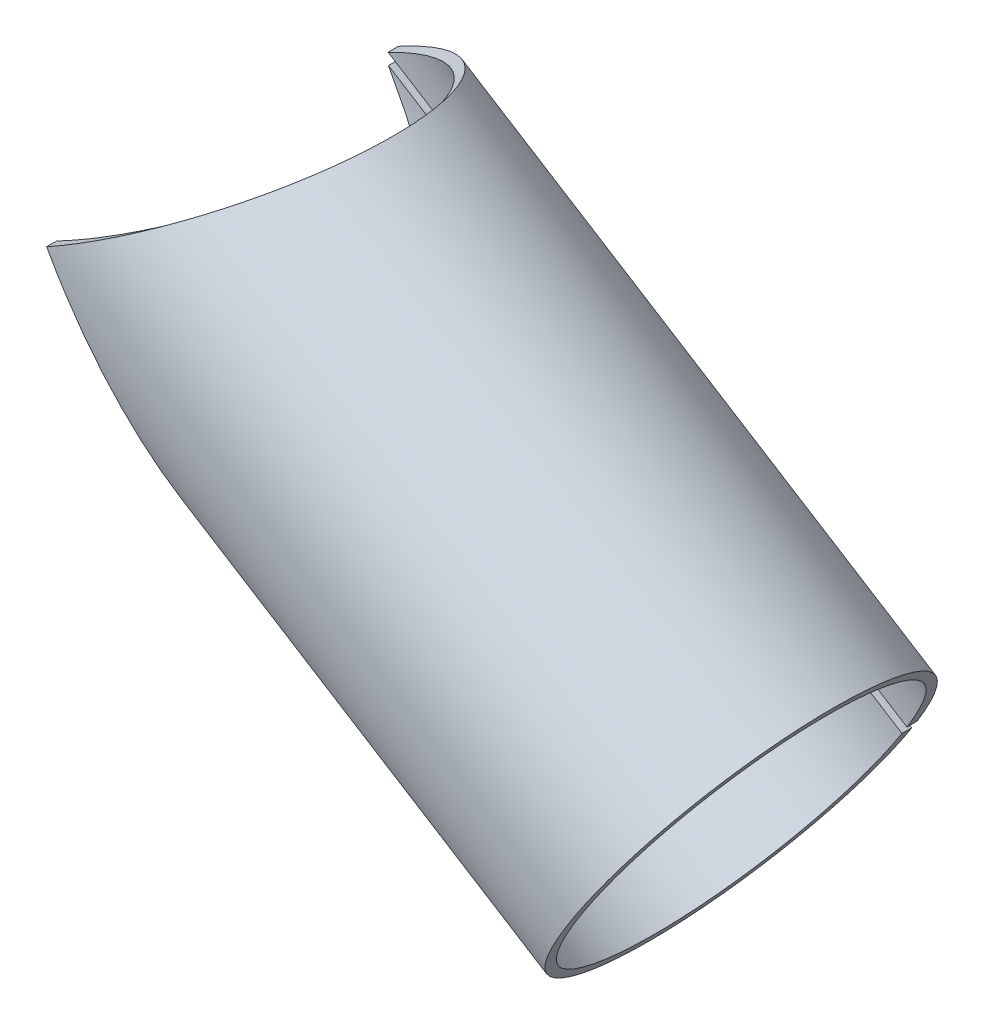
ISO-10303-21;
HEADER;
FILE_DESCRIPTION(('STEP AP214'),'2;1');
FILE_NAME('part.step','',(''),(''),'','','');
FILE_SCHEMA(('AUTOMOTIVE_DESIGN { 1 0 10303 214 1 1 1 1 }'));
ENDSEC;
DATA;
#1=APPLICATION_CONTEXT('core data for automotive mechanical design processes');
#2=APPLICATION_PROTOCOL_DEFINITION('international standard','automotive_design',2000,#1);
#3=PRODUCT_CONTEXT('',#1,'mechanical');
#4=PRODUCT('Part','Part','',(#3));
#5=PRODUCT_RELATED_PRODUCT_CATEGORY('part','',(#4));
#6=PRODUCT_DEFINITION_FORMATION('','',#4);
#7=PRODUCT_DEFINITION_CONTEXT('part definition',#1,'design');
#8=PRODUCT_DEFINITION('design','',#6,#7);
#9=PRODUCT_DEFINITION_SHAPE('','',#8);
#10=(LENGTH_UNIT() NAMED_UNIT(*) SI_UNIT(.MILLI.,.METRE.));
#11=(NAMED_UNIT(*) PLANE_ANGLE_UNIT() SI_UNIT($,.RADIAN.));
#12=(NAMED_UNIT(*) SI_UNIT($,.STERADIAN.) SOLID_ANGLE_UNIT());
#13=UNCERTAINTY_MEASURE_WITH_UNIT(LENGTH_MEASURE(1.E-05),#10,'distance_accuracy_value','');
#14=(GEOMETRIC_REPRESENTATION_CONTEXT(3) GLOBAL_UNCERTAINTY_ASSIGNED_CONTEXT((#13)) GLOBAL_UNIT_ASSIGNED_CONTEXT((#10,
#11,#12)) REPRESENTATION_CONTEXT('',''));
#15=CARTESIAN_POINT('',(0.,0.,0.));
#16=DIRECTION('',(0.,0.,1.));
#17=DIRECTION('',(1.,0.,0.));
#18=AXIS2_PLACEMENT_3D('',#15,#16,#17);
#19=CARTESIAN_POINT('',(0.,-3.11703878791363E-13,17.3630786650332));
#20=CARTESIAN_POINT('',(0.844727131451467,-1.5259496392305,17.3630786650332));
#21=CARTESIAN_POINT('',(1.53237967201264,-2.7692713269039,17.3035122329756));
#22=CARTESIAN_POINT('',(2.1969852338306,-3.96903968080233,17.2240064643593));
#23=CARTESIAN_POINT('',(2.32012526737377,-4.19130847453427,17.2077302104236));
#24=CARTESIAN_POINT('',(2.49012200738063,-4.49825090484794,17.1836843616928));
#25=CARTESIAN_POINT('',(2.54362682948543,-4.59488396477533,17.1758370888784));
#26=CARTESIAN_POINT('',(2.64991148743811,-4.78685825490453,17.1597635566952));
#27=CARTESIAN_POINT('',(2.70272431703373,-4.88225643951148,17.1515235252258));
#28=CARTESIAN_POINT('',(2.96514365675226,-5.35629826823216,17.1093485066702));
#29=CARTESIAN_POINT('',(3.16981709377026,-5.72609247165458,17.0724907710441));
#30=CARTESIAN_POINT('',(3.76812123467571,-6.80704566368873,16.9541132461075));
#31=CARTESIAN_POINT('',(4.14604926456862,-7.48975368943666,16.8648147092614));
#32=CARTESIAN_POINT('',(4.68153132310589,-8.4569212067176,16.7210499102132));
#33=CARTESIAN_POINT('',(4.85478676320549,-8.76983367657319,16.671485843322));
#34=CARTESIAN_POINT('',(5.19078330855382,-9.37676455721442,16.5699542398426));
#35=CARTESIAN_POINT('',(5.35508111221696,-9.67359397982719,16.5175314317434));
#36=CARTESIAN_POINT('',(6.16561384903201,-11.1379633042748,16.2458461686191));
#37=CARTESIAN_POINT('',(6.77155874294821,-12.232518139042,16.0002186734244));
#38=CARTESIAN_POINT('',(7.47584612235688,-13.504603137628,15.6720288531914));
#39=CARTESIAN_POINT('',(7.61377909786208,-13.7537574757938,15.6054579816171));
#40=CARTESIAN_POINT('',(7.88617623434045,-14.2458431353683,15.4695810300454));
#41=CARTESIAN_POINT('',(8.02053282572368,-14.4885733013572,15.4003184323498));
#42=CARTESIAN_POINT('',(8.41808989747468,-15.2068046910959,15.1888476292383));
#43=CARTESIAN_POINT('',(8.67577957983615,-15.6723437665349,15.0429583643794));
#44=CARTESIAN_POINT('',(9.17648493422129,-16.5768219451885,14.7428610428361));
#45=CARTESIAN_POINT('',(9.41950039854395,-17.0157613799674,14.5886531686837));
#46=CARTESIAN_POINT('',(9.89082117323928,-17.8670979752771,14.2733531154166));
#47=CARTESIAN_POINT('',(10.118705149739,-18.2787772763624,14.1125666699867));
#48=CARTESIAN_POINT('',(10.7852706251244,-19.4830351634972,13.6182769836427));
#49=CARTESIAN_POINT('',(11.2058389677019,-20.2428265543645,13.2734928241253));
#50=CARTESIAN_POINT('',(11.8010334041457,-21.3178552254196,12.7389773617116));
#51=CARTESIAN_POINT('',(11.9934844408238,-21.6654282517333,12.5579119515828));
#52=CARTESIAN_POINT('',(12.3664555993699,-22.3390931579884,12.1908703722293));
#53=CARTESIAN_POINT('',(12.5468713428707,-22.6650265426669,12.0050023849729));
#54=CARTESIAN_POINT('',(13.0730919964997,-23.6157222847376,11.4383231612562));
#55=CARTESIAN_POINT('',(13.4029731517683,-24.2117023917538,11.0493157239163));
#56=CARTESIAN_POINT('',(14.0209461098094,-25.3279073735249,10.2539205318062));
#57=CARTESIAN_POINT('',(14.309036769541,-25.8481340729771,9.84753429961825));
#58=CARTESIAN_POINT('',(14.8432170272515,-26.8131702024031,9.02217466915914));
#59=CARTESIAN_POINT('',(15.0906269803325,-27.2603399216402,8.60122350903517));
#60=CARTESIAN_POINT('',(15.7750634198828,-28.4970911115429,7.31784737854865));
#61=CARTESIAN_POINT('',(16.1538533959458,-29.1808349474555,6.43592208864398));
#62=CARTESIAN_POINT('',(16.7562738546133,-30.269228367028,4.64658894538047));
#63=CARTESIAN_POINT('',(16.9823495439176,-30.6782954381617,3.73178893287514));
#64=CARTESIAN_POINT('',(17.2850615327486,-31.2248458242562,1.88701543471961));
#65=CARTESIAN_POINT('',(17.3613627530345,-31.3621514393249,0.958023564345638));
#66=CARTESIAN_POINT('',(17.364746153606,-31.3682168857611,-0.895367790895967));
#67=CARTESIAN_POINT('',(17.2914495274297,-31.2365687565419,-1.82587882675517));
#68=CARTESIAN_POINT('',(17.0696525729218,-30.8358587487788,-3.20967373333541));
#69=CARTESIAN_POINT('',(16.9770673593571,-30.6684447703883,-3.66890873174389));
#70=CARTESIAN_POINT('',(16.7545128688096,-30.266053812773,-4.58022479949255));
#71=CARTESIAN_POINT('',(16.6247158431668,-30.031443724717,-5.03168650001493));
#72=CARTESIAN_POINT('',(16.1774955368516,-29.2237909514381,-6.37577019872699));
#73=CARTESIAN_POINT('',(15.8022331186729,-28.5460992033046,-7.258908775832));
#74=CARTESIAN_POINT('',(15.1239071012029,-27.3202921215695,-8.54277344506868));
#75=CARTESIAN_POINT('',(14.8789574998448,-26.8776600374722,-8.9632142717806));
#76=CARTESIAN_POINT('',(14.3478727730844,-25.9184134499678,-9.79071006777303));
#77=CARTESIAN_POINT('',(14.0617248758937,-25.4016253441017,-10.1978139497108));
#78=CARTESIAN_POINT('',(13.448325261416,-24.2935483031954,-10.9941077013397));
#79=CARTESIAN_POINT('',(13.1210745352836,-23.7022577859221,-11.3832960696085));
#80=CARTESIAN_POINT('',(12.4253054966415,-22.4454373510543,-12.138899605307));
#81=CARTESIAN_POINT('',(12.0547610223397,-21.7763161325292,-12.507505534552));
#82=CARTESIAN_POINT('',(11.2669820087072,-20.3533211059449,-13.2215323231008));
#83=CARTESIAN_POINT('',(10.8500138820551,-19.5999143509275,-13.5666681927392));
#84=CARTESIAN_POINT('',(9.96973242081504,-18.0095824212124,-14.2261946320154));
#85=CARTESIAN_POINT('',(9.50151617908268,-17.1639841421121,-14.5441676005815));
#86=CARTESIAN_POINT('',(8.75673051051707,-15.8185241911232,-14.9959763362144));
#87=CARTESIAN_POINT('',(8.50141807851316,-15.3572604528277,-15.1423564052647));
#88=CARTESIAN_POINT('',(7.97665241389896,-14.4092422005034,-15.4252705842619));
#89=CARTESIAN_POINT('',(7.70715771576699,-13.9224689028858,-15.5618832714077));
#90=CARTESIAN_POINT('',(6.86641915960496,-12.4039340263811,-15.9596581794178));
#91=CARTESIAN_POINT('',(6.26671565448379,-11.3204338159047,-16.2068129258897));
#92=CARTESIAN_POINT('',(5.46790991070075,-9.87738833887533,-16.4805095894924));
#93=CARTESIAN_POINT('',(5.30529526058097,-9.58366467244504,-16.5336341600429));
#94=CARTESIAN_POINT('',(4.97011661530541,-8.97826527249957,-16.6374427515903));
#95=CARTESIAN_POINT('',(4.79814999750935,-8.66766028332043,-16.6879207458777));
#96=CARTESIAN_POINT('',(4.26914318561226,-7.71208965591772,-16.8339992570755));
#97=CARTESIAN_POINT('',(3.89900748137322,-7.04335008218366,-16.9242608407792));
#98=CARTESIAN_POINT('',(3.41443640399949,-6.16792306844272,-17.024337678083));
#99=CARTESIAN_POINT('',(3.31642622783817,-5.99086395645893,-17.043714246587));
#100=CARTESIAN_POINT('',(3.16776289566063,-5.72232131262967,-17.0717450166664));
#101=CARTESIAN_POINT('',(3.11793376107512,-5.63231478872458,-17.0809162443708));
#102=CARTESIAN_POINT('',(3.01772526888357,-5.45131846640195,-17.0989011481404));
#103=CARTESIAN_POINT('',(2.96741382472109,-5.36045191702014,-17.107706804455));
#104=CARTESIAN_POINT('',(2.7078670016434,-4.8917605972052,-17.1518932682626));
#105=CARTESIAN_POINT('',(2.47991873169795,-4.48027693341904,-17.1868288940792));
#106=CARTESIAN_POINT('',(1.73541252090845,-3.13580145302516,-17.2832999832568));
#107=CARTESIAN_POINT('',(1.15837604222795,-2.09260506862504,-17.3369091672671));
#108=CARTESIAN_POINT('',(0.500000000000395,-0.90321633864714,-17.3558779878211));
#109=CARTESIAN_POINT('',(0.,-2.9813402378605E-13,16.3630786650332));
#110=CARTESIAN_POINT('',(0.870546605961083,-1.4847066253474,16.3630786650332));
#111=CARTESIAN_POINT('',(1.57926082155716,-2.69443244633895,16.3069428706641));
#112=CARTESIAN_POINT('',(2.26416576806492,-3.86179580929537,16.2320161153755));
#113=CARTESIAN_POINT('',(2.39106621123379,-4.07806166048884,16.2166772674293));
#114=CARTESIAN_POINT('',(2.56625676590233,-4.37671292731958,16.1940163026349));
#115=CARTESIAN_POINT('',(2.62139696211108,-4.47073535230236,16.1866209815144));
#116=CARTESIAN_POINT('',(2.73093066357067,-4.65752302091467,16.1714731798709));
#117=CARTESIAN_POINT('',(2.78535810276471,-4.75034371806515,16.1637077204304));
#118=CARTESIAN_POINT('',(3.05580077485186,-5.21157747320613,16.1239617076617));
#119=CARTESIAN_POINT('',(3.26673370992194,-5.57137930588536,16.0892267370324));
#120=CARTESIAN_POINT('',(3.88333481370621,-6.62312407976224,15.9776669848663));
#121=CARTESIAN_POINT('',(4.27281799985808,-7.28738599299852,15.8935114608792));
#122=CARTESIAN_POINT('',(4.8246684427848,-8.22842378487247,15.7580265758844));
#123=CARTESIAN_POINT('',(5.00321949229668,-8.53288259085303,15.711317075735));
#124=CARTESIAN_POINT('',(5.34948836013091,-9.12341521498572,15.6156330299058));
#125=CARTESIAN_POINT('',(5.5188104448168,-9.41222410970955,15.5662294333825));
#126=CARTESIAN_POINT('',(6.35412996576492,-10.8370249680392,15.3101914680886));
#127=CARTESIAN_POINT('',(6.97860023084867,-11.9020067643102,15.0787105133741));
#128=CARTESIAN_POINT('',(7.70441667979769,-13.1397237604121,14.7694222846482));
#129=CARTESIAN_POINT('',(7.84656657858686,-13.3821463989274,14.7066854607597));
#130=CARTESIAN_POINT('',(8.12729262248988,-13.8609361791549,14.5786341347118));
#131=CARTESIAN_POINT('',(8.26575773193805,-14.097107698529,14.5133606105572));
#132=CARTESIAN_POINT('',(8.6754717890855,-14.7959322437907,14.3140691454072));
#133=CARTESIAN_POINT('',(8.94104126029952,-15.248892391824,14.1765821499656));
#134=CARTESIAN_POINT('',(9.45705514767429,-16.1289327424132,13.8937684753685));
#135=CARTESIAN_POINT('',(9.70749936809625,-16.5560132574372,13.7484419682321));
#136=CARTESIAN_POINT('',(10.1932286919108,-17.3843487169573,13.4513011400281));
#137=CARTESIAN_POINT('',(10.4280807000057,-17.7849045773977,13.2997749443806));
#138=CARTESIAN_POINT('',(11.1150300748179,-18.9566225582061,12.833953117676));
#139=CARTESIAN_POINT('',(11.5484587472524,-19.695884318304,12.5090262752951));
#140=CARTESIAN_POINT('',(12.1618471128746,-20.7418690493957,12.0052954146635));
#141=CARTESIAN_POINT('',(12.3601802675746,-21.080052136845,11.8346581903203));
#142=CARTESIAN_POINT('',(12.7445527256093,-21.7355165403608,11.4887558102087));
#143=CARTESIAN_POINT('',(12.9304852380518,-22.0526432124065,11.3135926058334));
#144=CARTESIAN_POINT('',(13.4727978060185,-22.9776505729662,10.7795504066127));
#145=CARTESIAN_POINT('',(13.8127668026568,-23.5575269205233,10.4129472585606));
#146=CARTESIAN_POINT('',(14.449630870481,-24.6435750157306,9.66336163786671));
#147=CARTESIAN_POINT('',(14.7465248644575,-25.1497484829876,9.28038060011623));
#148=CARTESIAN_POINT('',(15.2970394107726,-26.0887093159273,8.50255629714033));
#149=CARTESIAN_POINT('',(15.5520200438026,-26.5237935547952,8.10584917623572));
#150=CARTESIAN_POINT('',(16.2573922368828,-27.7271238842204,6.89638713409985));
#151=CARTESIAN_POINT('',(16.647750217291,-28.3924010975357,6.06525498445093));
#152=CARTESIAN_POINT('',(17.2685936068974,-29.4513850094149,4.37897575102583));
#153=CARTESIAN_POINT('',(17.5015989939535,-29.8493898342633,3.5168622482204));
#154=CARTESIAN_POINT('',(17.8135590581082,-30.3811770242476,1.77833566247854));
#155=CARTESIAN_POINT('',(17.892179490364,-30.514780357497,0.902847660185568));
#156=CARTESIAN_POINT('',(17.8956651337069,-30.5206825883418,-0.843800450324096));
#157=CARTESIAN_POINT('',(17.8201471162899,-30.3925805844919,-1.72072012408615));
#158=CARTESIAN_POINT('',(17.5915675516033,-30.0026980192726,-3.02481747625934));
#159=CARTESIAN_POINT('',(17.4961473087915,-29.8398097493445,-3.45760353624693));
#160=CARTESIAN_POINT('',(17.2667789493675,-29.4482961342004,-4.31643374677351));
#161=CARTESIAN_POINT('',(17.1330097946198,-29.2200269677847,-4.7418942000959));
#162=CARTESIAN_POINT('',(16.6721216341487,-28.4341929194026,-6.00856745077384));
#163=CARTESIAN_POINT('',(16.2853907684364,-27.7748088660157,-6.84084301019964));
#164=CARTESIAN_POINT('',(15.5863133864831,-26.5821282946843,-8.05076545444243));
#165=CARTESIAN_POINT('',(15.3338707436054,-26.1514577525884,-8.44699163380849));
#166=CARTESIAN_POINT('',(14.7865514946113,-25.2181271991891,-9.22682907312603));
#167=CARTESIAN_POINT('',(14.4916578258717,-24.715300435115,-9.61048642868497));
#168=CARTESIAN_POINT('',(13.8595034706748,-23.6371625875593,-10.3609188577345));
#169=CARTESIAN_POINT('',(13.5222437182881,-23.0618500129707,-10.7276925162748));
#170=CARTESIAN_POINT('',(12.8052028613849,-21.8389869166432,-11.4397782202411));
#171=CARTESIAN_POINT('',(12.4233354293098,-21.1879411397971,-11.7871548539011));
#172=CARTESIAN_POINT('',(11.6114723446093,-19.8033928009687,-12.4600583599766));
#173=CARTESIAN_POINT('',(11.1817508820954,-19.0703448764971,-12.7853166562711));
#174=CARTESIAN_POINT('',(10.2745509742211,-17.5229842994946,-13.4068586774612));
#175=CARTESIAN_POINT('',(9.79202447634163,-16.7002302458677,-13.7065184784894));
#176=CARTESIAN_POINT('',(9.02446588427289,-15.391123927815,-14.1323059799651));
#177=CARTESIAN_POINT('',(8.76134585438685,-14.942323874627,-14.2702555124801));
#178=CARTESIAN_POINT('',(8.22053403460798,-14.0199209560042,-14.5368756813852));
#179=CARTESIAN_POINT('',(7.94280096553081,-13.5462990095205,-14.6656203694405));
#180=CARTESIAN_POINT('',(7.07636243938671,-12.0687903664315,-15.0404860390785));
#181=CARTESIAN_POINT('',(6.45831868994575,-11.014567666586,-15.2734062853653));
#182=CARTESIAN_POINT('',(5.63508833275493,-9.61051250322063,-15.5313398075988));
#183=CARTESIAN_POINT('',(5.46750255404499,-9.32472451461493,-15.5814047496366));
#184=CARTESIAN_POINT('',(5.12207799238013,-8.73568121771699,-15.6792346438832));
#185=CARTESIAN_POINT('',(4.94485463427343,-8.43346784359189,-15.7268054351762));
#186=CARTESIAN_POINT('',(4.39967481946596,-7.50371504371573,-15.8644707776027));
#187=CARTESIAN_POINT('',(4.01821941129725,-6.8530457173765,-15.9495338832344));
#188=CARTESIAN_POINT('',(3.5188306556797,-6.00127295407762,-16.0438469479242));
#189=CARTESIAN_POINT('',(3.41782359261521,-5.82899793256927,-16.0621075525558));
#190=CARTESIAN_POINT('',(3.26461514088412,-5.5677109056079,-16.0885239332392));
#191=CARTESIAN_POINT('',(3.21326266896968,-5.48013616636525,-16.0971669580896));
#192=CARTESIAN_POINT('',(3.10999095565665,-5.30402982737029,-16.1141160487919));
#193=CARTESIAN_POINT('',(3.05814171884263,-5.21561813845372,-16.1224145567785));
#194=CARTESIAN_POINT('',(2.79066357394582,-4.75958801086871,-16.1640561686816));
#195=CARTESIAN_POINT('',(2.555753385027,-4.35921802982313,-16.1969797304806));
#196=CARTESIAN_POINT('',(1.78849522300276,-3.05106270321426,-16.2878947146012));
#197=CARTESIAN_POINT('',(1.19379190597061,-2.03605900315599,-16.3384164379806));
#198=CARTESIAN_POINT('',(0.515287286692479,-0.878812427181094,-16.3562926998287));
#199=B_SPLINE_SURFACE_WITH_KNOTS('',1,3,((#19,#20,#21,#22,#23,#24,#25,#26,#27,#28,#29,#30,#31,
#32,#33,#34,#35,#36,#37,#38,#39,#40,#41,#42,#43,#44,#45,#46,#47,#48,#49,#50,#51,#52,#53,#54,#55,
#56,#57,#58,#59,#60,#61,#62,#63,#64,#65,#66,#67,#68,#69,#70,#71,#72,#73,#74,#75,#76,#77,#78,#79,
#80,#81,#82,#83,#84,#85,#86,#87,#88,#89,#90,#91,#92,#93,#94,#95,#96,#97,#98,#99,#100,#101,#102,
#103,#104,#105,#106,#107,#108),(#109,#110,#111,#112,#113,#114,#115,#116,#117,#118,#119,#120,
#121,#122,#123,#124,#125,#126,#127,#128,#129,#130,#131,#132,#133,#134,#135,#136,#137,#138,#139,
#140,#141,#142,#143,#144,#145,#146,#147,#148,#149,#150,#151,#152,#153,#154,#155,#156,#157,#158,
#159,#160,#161,#162,#163,#164,#165,#166,#167,#168,#169,#170,#171,#172,#173,#174,#175,#176,#177,
#178,#179,#180,#181,#182,#183,#184,#185,#186,#187,#188,#189,#190,#191,#192,#193,#194,#195,#196,
#197,#198)),.UNSPECIFIED.,.F.,.F.,.F.,(2,2),(4,2,2,2,2,2,2,2,2,2,2,2,2,2,2,2,2,2,2,2,2,2,2,2,2,
2,2,2,2,2,2,2,2,2,2,2,2,2,2,2,2,2,2,2,4),(0.,1.),(0.,0.015625,0.01953125,0.021484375,0.0234375,
0.03125,0.046875,0.0546875,0.0625,0.09375,0.1015625,0.109375,0.125,0.140625,0.15625,0.1875,
0.203125,0.21875,0.25,0.28125,0.3125,0.375,0.4375,0.5,0.5625,0.59375,0.625,0.6875,0.71875,0.75,
0.78125,0.8125,0.84375,0.875,0.890625,0.90625,0.9375,0.9453125,0.953125,0.96875,0.97265625,
0.974609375,0.9765625,0.984375,1.),.UNSPECIFIED.);
#200=CARTESIAN_POINT('',(0.,-2.9813402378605E-13,16.3630786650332));
#201=CARTESIAN_POINT('',(0.,-3.11703878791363E-13,17.3630786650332));
#202=B_SPLINE_CURVE_WITH_KNOTS('',1,(#200,#201),.UNSPECIFIED.,.F.,.F.,(2,2),(0.,1.),.UNSPECIFIED.);
#203=CARTESIAN_POINT('',(0.,-2.9813402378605E-13,16.3630786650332));
#204=VERTEX_POINT('',#203);
#205=CARTESIAN_POINT('',(2.11872909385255E-07,-3.82736161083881E-07,17.3630786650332));
#206=VERTEX_POINT('',#205);
#207=EDGE_CURVE('E13',#204,#206,#202,.T.);
#208=CARTESIAN_POINT('',(0.,-2.9813402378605E-13,16.3630786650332));
#209=CARTESIAN_POINT('',(0.870546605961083,-1.4847066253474,16.3630786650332));
#210=CARTESIAN_POINT('',(1.57926082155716,-2.69443244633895,16.3069428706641));
#211=CARTESIAN_POINT('',(2.26416576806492,-3.86179580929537,16.2320161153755));
#212=CARTESIAN_POINT('',(2.39106621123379,-4.07806166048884,16.2166772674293));
#213=CARTESIAN_POINT('',(2.56625676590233,-4.37671292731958,16.1940163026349));
#214=CARTESIAN_POINT('',(2.62139696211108,-4.47073535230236,16.1866209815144));
#215=CARTESIAN_POINT('',(2.73093066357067,-4.65752302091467,16.1714731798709));
#216=CARTESIAN_POINT('',(2.78535810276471,-4.75034371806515,16.1637077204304));
#217=CARTESIAN_POINT('',(3.05580077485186,-5.21157747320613,16.1239617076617));
#218=CARTESIAN_POINT('',(3.26673370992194,-5.57137930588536,16.0892267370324));
#219=CARTESIAN_POINT('',(3.88333481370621,-6.62312407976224,15.9776669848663));
#220=CARTESIAN_POINT('',(4.27281799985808,-7.28738599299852,15.8935114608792));
#221=CARTESIAN_POINT('',(4.8246684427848,-8.22842378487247,15.7580265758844));
#222=CARTESIAN_POINT('',(5.00321949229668,-8.53288259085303,15.711317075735));
#223=CARTESIAN_POINT('',(5.34948836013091,-9.12341521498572,15.6156330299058));
#224=CARTESIAN_POINT('',(5.5188104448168,-9.41222410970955,15.5662294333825));
#225=CARTESIAN_POINT('',(6.35412996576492,-10.8370249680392,15.3101914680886));
#226=CARTESIAN_POINT('',(6.97860023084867,-11.9020067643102,15.0787105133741));
#227=CARTESIAN_POINT('',(7.70441667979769,-13.1397237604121,14.7694222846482));
#228=CARTESIAN_POINT('',(7.84656657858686,-13.3821463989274,14.7066854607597));
#229=CARTESIAN_POINT('',(8.12729262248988,-13.8609361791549,14.5786341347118));
#230=CARTESIAN_POINT('',(8.26575773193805,-14.097107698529,14.5133606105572));
#231=CARTESIAN_POINT('',(8.6754717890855,-14.7959322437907,14.3140691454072));
#232=CARTESIAN_POINT('',(8.94104126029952,-15.248892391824,14.1765821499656));
#233=CARTESIAN_POINT('',(9.45705514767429,-16.1289327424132,13.8937684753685));
#234=CARTESIAN_POINT('',(9.70749936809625,-16.5560132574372,13.7484419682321));
#235=CARTESIAN_POINT('',(10.1932286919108,-17.3843487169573,13.4513011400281));
#236=CARTESIAN_POINT('',(10.4280807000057,-17.7849045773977,13.2997749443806));
#237=CARTESIAN_POINT('',(11.1150300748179,-18.9566225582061,12.833953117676));
#238=CARTESIAN_POINT('',(11.5484587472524,-19.695884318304,12.5090262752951));
#239=CARTESIAN_POINT('',(12.1618471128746,-20.7418690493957,12.0052954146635));
#240=CARTESIAN_POINT('',(12.3601802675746,-21.080052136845,11.8346581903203));
#241=CARTESIAN_POINT('',(12.7445527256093,-21.7355165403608,11.4887558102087));
#242=CARTESIAN_POINT('',(12.9304852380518,-22.0526432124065,11.3135926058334));
#243=CARTESIAN_POINT('',(13.4727978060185,-22.9776505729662,10.7795504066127));
#244=CARTESIAN_POINT('',(13.8127668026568,-23.5575269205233,10.4129472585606));
#245=CARTESIAN_POINT('',(14.449630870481,-24.6435750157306,9.66336163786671));
#246=CARTESIAN_POINT('',(14.7465248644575,-25.1497484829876,9.28038060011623));
#247=CARTESIAN_POINT('',(15.2970394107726,-26.0887093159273,8.50255629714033));
#248=CARTESIAN_POINT('',(15.5520200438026,-26.5237935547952,8.10584917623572));
#249=CARTESIAN_POINT('',(16.2573922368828,-27.7271238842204,6.89638713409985));
#250=CARTESIAN_POINT('',(16.647750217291,-28.3924010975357,6.06525498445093));
#251=CARTESIAN_POINT('',(17.2685936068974,-29.4513850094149,4.37897575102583));
#252=CARTESIAN_POINT('',(17.5015989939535,-29.8493898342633,3.5168622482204));
#253=CARTESIAN_POINT('',(17.8135590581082,-30.3811770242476,1.77833566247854));
#254=CARTESIAN_POINT('',(17.892179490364,-30.514780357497,0.902847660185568));
#255=CARTESIAN_POINT('',(17.8956651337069,-30.5206825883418,-0.843800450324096));
#256=CARTESIAN_POINT('',(17.8201471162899,-30.3925805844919,-1.72072012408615));
#257=CARTESIAN_POINT('',(17.5915675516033,-30.0026980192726,-3.02481747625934));
#258=CARTESIAN_POINT('',(17.4961473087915,-29.8398097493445,-3.45760353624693));
#259=CARTESIAN_POINT('',(17.2667789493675,-29.4482961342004,-4.31643374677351));
#260=CARTESIAN_POINT('',(17.1330097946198,-29.2200269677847,-4.7418942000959));
#261=CARTESIAN_POINT('',(16.6721216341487,-28.4341929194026,-6.00856745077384));
#262=CARTESIAN_POINT('',(16.2853907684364,-27.7748088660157,-6.84084301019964));
#263=CARTESIAN_POINT('',(15.5863133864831,-26.5821282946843,-8.05076545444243));
#264=CARTESIAN_POINT('',(15.3338707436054,-26.1514577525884,-8.44699163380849));
#265=CARTESIAN_POINT('',(14.7865514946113,-25.2181271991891,-9.22682907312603));
#266=CARTESIAN_POINT('',(14.4916578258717,-24.715300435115,-9.61048642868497));
#267=CARTESIAN_POINT('',(13.8595034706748,-23.6371625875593,-10.3609188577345));
#268=CARTESIAN_POINT('',(13.5222437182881,-23.0618500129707,-10.7276925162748));
#269=CARTESIAN_POINT('',(12.8052028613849,-21.8389869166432,-11.4397782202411));
#270=CARTESIAN_POINT('',(12.4233354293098,-21.1879411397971,-11.7871548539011));
#271=CARTESIAN_POINT('',(11.6114723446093,-19.8033928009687,-12.4600583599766));
#272=CARTESIAN_POINT('',(11.1817508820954,-19.0703448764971,-12.7853166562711));
#273=CARTESIAN_POINT('',(10.2745509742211,-17.5229842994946,-13.4068586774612));
#274=CARTESIAN_POINT('',(9.79202447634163,-16.7002302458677,-13.7065184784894));
#275=CARTESIAN_POINT('',(9.02446588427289,-15.391123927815,-14.1323059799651));
#276=CARTESIAN_POINT('',(8.76134585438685,-14.942323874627,-14.2702555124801));
#277=CARTESIAN_POINT('',(8.22053403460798,-14.0199209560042,-14.5368756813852));
#278=CARTESIAN_POINT('',(7.94280096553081,-13.5462990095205,-14.6656203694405));
#279=CARTESIAN_POINT('',(7.07636243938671,-12.0687903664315,-15.0404860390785));
#280=CARTESIAN_POINT('',(6.45831868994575,-11.014567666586,-15.2734062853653));
#281=CARTESIAN_POINT('',(5.63508833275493,-9.61051250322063,-15.5313398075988));
#282=CARTESIAN_POINT('',(5.46750255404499,-9.32472451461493,-15.5814047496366));
#283=CARTESIAN_POINT('',(5.12207799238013,-8.73568121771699,-15.6792346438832));
#284=CARTESIAN_POINT('',(4.94485463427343,-8.43346784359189,-15.7268054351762));
#285=CARTESIAN_POINT('',(4.39967481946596,-7.50371504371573,-15.8644707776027));
#286=CARTESIAN_POINT('',(4.01821941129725,-6.8530457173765,-15.9495338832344));
#287=CARTESIAN_POINT('',(3.5188306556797,-6.00127295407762,-16.0438469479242));
#288=CARTESIAN_POINT('',(3.41782359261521,-5.82899793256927,-16.0621075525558));
#289=CARTESIAN_POINT('',(3.26461514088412,-5.5677109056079,-16.0885239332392));
#290=CARTESIAN_POINT('',(3.21326266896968,-5.48013616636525,-16.0971669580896));
#291=CARTESIAN_POINT('',(3.10999095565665,-5.30402982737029,-16.1141160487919));
#292=CARTESIAN_POINT('',(3.05814171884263,-5.21561813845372,-16.1224145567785));
#293=CARTESIAN_POINT('',(2.79066357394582,-4.75958801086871,-16.1640561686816));
#294=CARTESIAN_POINT('',(2.555753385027,-4.35921802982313,-16.1969797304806));
#295=CARTESIAN_POINT('',(1.78849522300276,-3.05106270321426,-16.2878947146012));
#296=CARTESIAN_POINT('',(1.19379190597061,-2.03605900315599,-16.3384164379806));
#297=CARTESIAN_POINT('',(0.515287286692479,-0.878812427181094,-16.3562926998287));
#298=B_SPLINE_CURVE_WITH_KNOTS('',3,(#208,#209,#210,#211,#212,#213,#214,#215,#216,#217,#218,
#219,#220,#221,#222,#223,#224,#225,#226,#227,#228,#229,#230,#231,#232,#233,#234,#235,#236,#237,
#238,#239,#240,#241,#242,#243,#244,#245,#246,#247,#248,#249,#250,#251,#252,#253,#254,#255,#256,
#257,#258,#259,#260,#261,#262,#263,#264,#265,#266,#267,#268,#269,#270,#271,#272,#273,#274,#275,
#276,#277,#278,#279,#280,#281,#282,#283,#284,#285,#286,#287,#288,#289,#290,#291,#292,#293,#294,
#295,#296,#297),.UNSPECIFIED.,.F.,.F.,(4,2,2,2,2,2,2,2,2,2,2,2,2,2,2,2,2,2,2,2,2,2,2,2,2,2,2,2,
2,2,2,2,2,2,2,2,2,2,2,2,2,2,2,2,4),(0.,0.015625,0.01953125,0.021484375,0.0234375,0.03125,
0.046875,0.0546875,0.0625,0.09375,0.1015625,0.109375,0.125,0.140625,0.15625,0.1875,0.203125,
0.21875,0.25,0.28125,0.3125,0.375,0.4375,0.5,0.5625,0.59375,0.625,0.6875,0.71875,0.75,0.78125,
0.8125,0.84375,0.875,0.890625,0.90625,0.9375,0.9453125,0.953125,0.96875,0.97265625,0.974609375,
0.9765625,0.984375,1.),.UNSPECIFIED.);
#299=CARTESIAN_POINT('',(0.515287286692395,-0.878812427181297,-16.3562926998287));
#300=VERTEX_POINT('',#299);
#301=EDGE_CURVE('E89',#204,#300,#298,.T.);
#302=CARTESIAN_POINT('',(0.515287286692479,-0.878812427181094,-16.3562926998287));
#303=CARTESIAN_POINT('',(0.500000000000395,-0.90321633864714,-17.3558779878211));
#304=B_SPLINE_CURVE_WITH_KNOTS('',1,(#302,#303),.UNSPECIFIED.,.F.,.F.,(2,2),(0.,1.),.UNSPECIFIED.);
#305=CARTESIAN_POINT('',(0.500000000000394,-0.903216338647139,-17.3558779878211));
#306=VERTEX_POINT('',#305);
#307=EDGE_CURVE('E52',#300,#306,#304,.T.);
#308=CARTESIAN_POINT('',(0.500000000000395,-0.90321633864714,-17.3558779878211));
#309=CARTESIAN_POINT('',(1.15837604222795,-2.09260506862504,-17.3369091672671));
#310=CARTESIAN_POINT('',(1.73541252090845,-3.13580145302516,-17.2832999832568));
#311=CARTESIAN_POINT('',(2.47991873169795,-4.48027693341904,-17.1868288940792));
#312=CARTESIAN_POINT('',(2.7078670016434,-4.8917605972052,-17.1518932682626));
#313=CARTESIAN_POINT('',(2.96741382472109,-5.36045191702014,-17.107706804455));
#314=CARTESIAN_POINT('',(3.01772526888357,-5.45131846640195,-17.0989011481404));
#315=CARTESIAN_POINT('',(3.11793376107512,-5.63231478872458,-17.0809162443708));
#316=CARTESIAN_POINT('',(3.16776289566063,-5.72232131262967,-17.0717450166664));
#317=CARTESIAN_POINT('',(3.31642622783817,-5.99086395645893,-17.043714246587));
#318=CARTESIAN_POINT('',(3.41443640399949,-6.16792306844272,-17.024337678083));
#319=CARTESIAN_POINT('',(3.89900748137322,-7.04335008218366,-16.9242608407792));
#320=CARTESIAN_POINT('',(4.26914318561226,-7.71208965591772,-16.8339992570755));
#321=CARTESIAN_POINT('',(4.79814999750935,-8.66766028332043,-16.6879207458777));
#322=CARTESIAN_POINT('',(4.97011661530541,-8.97826527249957,-16.6374427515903));
#323=CARTESIAN_POINT('',(5.30529526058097,-9.58366467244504,-16.5336341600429));
#324=CARTESIAN_POINT('',(5.46790991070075,-9.87738833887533,-16.4805095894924));
#325=CARTESIAN_POINT('',(6.26671565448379,-11.3204338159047,-16.2068129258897));
#326=CARTESIAN_POINT('',(6.86641915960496,-12.4039340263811,-15.9596581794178));
#327=CARTESIAN_POINT('',(7.70715771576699,-13.9224689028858,-15.5618832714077));
#328=CARTESIAN_POINT('',(7.97665241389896,-14.4092422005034,-15.4252705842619));
#329=CARTESIAN_POINT('',(8.50141807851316,-15.3572604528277,-15.1423564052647));
#330=CARTESIAN_POINT('',(8.75673051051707,-15.8185241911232,-14.9959763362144));
#331=CARTESIAN_POINT('',(9.50151617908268,-17.1639841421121,-14.5441676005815));
#332=CARTESIAN_POINT('',(9.96973242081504,-18.0095824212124,-14.2261946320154));
#333=CARTESIAN_POINT('',(10.8500138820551,-19.5999143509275,-13.5666681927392));
#334=CARTESIAN_POINT('',(11.2669820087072,-20.3533211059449,-13.2215323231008));
#335=CARTESIAN_POINT('',(12.0547610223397,-21.7763161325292,-12.507505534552));
#336=CARTESIAN_POINT('',(12.4253054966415,-22.4454373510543,-12.138899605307));
#337=CARTESIAN_POINT('',(13.1210745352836,-23.7022577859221,-11.3832960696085));
#338=CARTESIAN_POINT('',(13.448325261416,-24.2935483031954,-10.9941077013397));
#339=CARTESIAN_POINT('',(14.0617248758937,-25.4016253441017,-10.1978139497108));
#340=CARTESIAN_POINT('',(14.3478727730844,-25.9184134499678,-9.79071006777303));
#341=CARTESIAN_POINT('',(14.8789574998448,-26.8776600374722,-8.9632142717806));
#342=CARTESIAN_POINT('',(15.1239071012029,-27.3202921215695,-8.54277344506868));
#343=CARTESIAN_POINT('',(15.8022331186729,-28.5460992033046,-7.258908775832));
#344=CARTESIAN_POINT('',(16.1774955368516,-29.2237909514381,-6.37577019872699));
#345=CARTESIAN_POINT('',(16.6247158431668,-30.031443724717,-5.03168650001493));
#346=CARTESIAN_POINT('',(16.7545128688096,-30.266053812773,-4.58022479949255));
#347=CARTESIAN_POINT('',(16.9770673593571,-30.6684447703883,-3.66890873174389));
#348=CARTESIAN_POINT('',(17.0696525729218,-30.8358587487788,-3.20967373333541));
#349=CARTESIAN_POINT('',(17.2914495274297,-31.2365687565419,-1.82587882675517));
#350=CARTESIAN_POINT('',(17.364746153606,-31.3682168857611,-0.895367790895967));
#351=CARTESIAN_POINT('',(17.3613627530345,-31.3621514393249,0.958023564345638));
#352=CARTESIAN_POINT('',(17.2850615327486,-31.2248458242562,1.88701543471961));
#353=CARTESIAN_POINT('',(16.9823495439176,-30.6782954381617,3.73178893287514));
#354=CARTESIAN_POINT('',(16.7562738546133,-30.269228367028,4.64658894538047));
#355=CARTESIAN_POINT('',(16.1538533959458,-29.1808349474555,6.43592208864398));
#356=CARTESIAN_POINT('',(15.7750634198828,-28.4970911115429,7.31784737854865));
#357=CARTESIAN_POINT('',(15.0906269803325,-27.2603399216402,8.60122350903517));
#358=CARTESIAN_POINT('',(14.8432170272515,-26.8131702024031,9.02217466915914));
#359=CARTESIAN_POINT('',(14.309036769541,-25.8481340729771,9.84753429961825));
#360=CARTESIAN_POINT('',(14.0209461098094,-25.3279073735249,10.2539205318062));
#361=CARTESIAN_POINT('',(13.4029731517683,-24.2117023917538,11.0493157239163));
#362=CARTESIAN_POINT('',(13.0730919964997,-23.6157222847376,11.4383231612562));
#363=CARTESIAN_POINT('',(12.5468713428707,-22.6650265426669,12.0050023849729));
#364=CARTESIAN_POINT('',(12.3664555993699,-22.3390931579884,12.1908703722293));
#365=CARTESIAN_POINT('',(11.9934844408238,-21.6654282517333,12.5579119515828));
#366=CARTESIAN_POINT('',(11.8010334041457,-21.3178552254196,12.7389773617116));
#367=CARTESIAN_POINT('',(11.2058389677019,-20.2428265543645,13.2734928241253));
#368=CARTESIAN_POINT('',(10.7852706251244,-19.4830351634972,13.6182769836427));
#369=CARTESIAN_POINT('',(10.118705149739,-18.2787772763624,14.1125666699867));
#370=CARTESIAN_POINT('',(9.89082117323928,-17.8670979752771,14.2733531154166));
#371=CARTESIAN_POINT('',(9.41950039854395,-17.0157613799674,14.5886531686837));
#372=CARTESIAN_POINT('',(9.17648493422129,-16.5768219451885,14.7428610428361));
#373=CARTESIAN_POINT('',(8.67577957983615,-15.6723437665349,15.0429583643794));
#374=CARTESIAN_POINT('',(8.41808989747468,-15.2068046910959,15.1888476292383));
#375=CARTESIAN_POINT('',(8.02053282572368,-14.4885733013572,15.4003184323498));
#376=CARTESIAN_POINT('',(7.88617623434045,-14.2458431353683,15.4695810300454));
#377=CARTESIAN_POINT('',(7.61377909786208,-13.7537574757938,15.6054579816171));
#378=CARTESIAN_POINT('',(7.47584612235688,-13.504603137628,15.6720288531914));
#379=CARTESIAN_POINT('',(6.77155874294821,-12.232518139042,16.0002186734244));
#380=CARTESIAN_POINT('',(6.16561384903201,-11.1379633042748,16.2458461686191));
#381=CARTESIAN_POINT('',(5.35508111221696,-9.67359397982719,16.5175314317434));
#382=CARTESIAN_POINT('',(5.19078330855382,-9.37676455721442,16.5699542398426));
#383=CARTESIAN_POINT('',(4.85478676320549,-8.76983367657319,16.671485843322));
#384=CARTESIAN_POINT('',(4.68153132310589,-8.4569212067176,16.7210499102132));
#385=CARTESIAN_POINT('',(4.14604926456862,-7.48975368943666,16.8648147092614));
#386=CARTESIAN_POINT('',(3.76812123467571,-6.80704566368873,16.9541132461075));
#387=CARTESIAN_POINT('',(3.16981709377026,-5.72609247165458,17.0724907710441));
#388=CARTESIAN_POINT('',(2.96514365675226,-5.35629826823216,17.1093485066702));
#389=CARTESIAN_POINT('',(2.70272431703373,-4.88225643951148,17.1515235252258));
#390=CARTESIAN_POINT('',(2.64991148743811,-4.78685825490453,17.1597635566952));
#391=CARTESIAN_POINT('',(2.54362682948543,-4.59488396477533,17.1758370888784));
#392=CARTESIAN_POINT('',(2.49012200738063,-4.49825090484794,17.1836843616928));
#393=CARTESIAN_POINT('',(2.32012526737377,-4.19130847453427,17.2077302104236));
#394=CARTESIAN_POINT('',(2.1969852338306,-3.96903968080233,17.2240064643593));
#395=CARTESIAN_POINT('',(1.53237967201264,-2.7692713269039,17.3035122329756));
#396=CARTESIAN_POINT('',(0.844727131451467,-1.5259496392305,17.3630786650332));
#397=CARTESIAN_POINT('',(0.,-3.11703878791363E-13,17.3630786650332));
#398=B_SPLINE_CURVE_WITH_KNOTS('',3,(#308,#309,#310,#311,#312,#313,#314,#315,#316,#317,#318,
#319,#320,#321,#322,#323,#324,#325,#326,#327,#328,#329,#330,#331,#332,#333,#334,#335,#336,#337,
#338,#339,#340,#341,#342,#343,#344,#345,#346,#347,#348,#349,#350,#351,#352,#353,#354,#355,#356,
#357,#358,#359,#360,#361,#362,#363,#364,#365,#366,#367,#368,#369,#370,#371,#372,#373,#374,#375,
#376,#377,#378,#379,#380,#381,#382,#383,#384,#385,#386,#387,#388,#389,#390,#391,#392,#393,#394,
#395,#396,#397),.UNSPECIFIED.,.F.,.F.,(4,2,2,2,2,2,2,2,2,2,2,2,2,2,2,2,2,2,2,2,2,2,2,2,2,2,2,2,
2,2,2,2,2,2,2,2,2,2,2,2,2,2,2,2,4),(0.,0.015625,0.0234375,0.025390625,0.02734375,0.03125,
0.046875,0.0546875,0.0625,0.09375,0.109375,0.125,0.15625,0.1875,0.21875,0.25,0.28125,0.3125,
0.375,0.40625,0.4375,0.5,0.5625,0.625,0.6875,0.71875,0.75,0.78125,0.796875,0.8125,0.84375,
0.859375,0.875,0.890625,0.8984375,0.90625,0.9375,0.9453125,0.953125,0.96875,0.9765625,
0.978515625,0.98046875,0.984375,1.),.UNSPECIFIED.);
#399=EDGE_CURVE('E92',#206,#306,#398,.F.);
#400=ORIENTED_EDGE('',*,*,#207,.F.);
#401=ORIENTED_EDGE('',*,*,#301,.T.);
#402=ORIENTED_EDGE('',*,*,#307,.T.);
#403=ORIENTED_EDGE('',*,*,#399,.F.);
#404=EDGE_LOOP('',(#400,#401,#402,#403));
#405=FACE_BOUND('',#404,.T.);
#406=ADVANCED_FACE('F38',(#405),#199,.T.);
#407=CARTESIAN_POINT('',(26.2307000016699,-16.9876598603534,-16.3562926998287));
#408=DIRECTION('',(0.530648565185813,0.847102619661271,-0.0287967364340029));
#409=DIRECTION('',(0.847454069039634,-0.530868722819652,0.));
#410=AXIS2_PLACEMENT_3D('',#407,#408,#409);
#411=PLANE('',#410);
#412=ORIENTED_EDGE('',*,*,#307,.F.);
#413=DIRECTION('',(0.847454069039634,-0.530868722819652,0.));
#414=VECTOR('',#413,1.);
#415=CARTESIAN_POINT('',(0.515287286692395,-0.878812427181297,-16.3562926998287));
#416=LINE('',#415,#414);
#417=CARTESIAN_POINT('',(51.9461127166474,-33.0965072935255,-16.3562926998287));
#418=VERTEX_POINT('',#417);
#419=EDGE_CURVE('E105',#300,#418,#416,.T.);
#420=ORIENTED_EDGE('',*,*,#419,.T.);
#421=DIRECTION('',(-0.0152872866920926,-0.024403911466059,-0.99958528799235));
#422=VECTOR('',#421,1.);
#423=CARTESIAN_POINT('',(51.9461127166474,-33.0965072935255,-16.3562926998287));
#424=LINE('',#423,#422);
#425=CARTESIAN_POINT('',(51.9308254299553,-33.1209112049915,-17.3558779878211));
#426=VERTEX_POINT('',#425);
#427=EDGE_CURVE('E128',#418,#426,#424,.T.);
#428=ORIENTED_EDGE('',*,*,#427,.T.);
#429=DIRECTION('',(-0.847454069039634,0.530868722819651,0.));
#430=VECTOR('',#429,1.);
#431=CARTESIAN_POINT('',(186.751979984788,-117.576620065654,-17.3558779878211));
#432=LINE('',#431,#430);
#433=EDGE_CURVE('E198',#306,#426,#432,.F.);
#434=ORIENTED_EDGE('',*,*,#433,.F.);
#435=EDGE_LOOP('',(#412,#420,#428,#434));
#436=FACE_BOUND('',#435,.T.);
#437=ADVANCED_FACE('F145',(#436),#411,.T.);
#438=CARTESIAN_POINT('',(52.1962597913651,-32.6971841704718,0.));
#439=DIRECTION('',(-0.847454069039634,0.530868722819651,0.));
#440=DIRECTION('',(-0.530868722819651,-0.847454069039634,0.));
#441=AXIS2_PLACEMENT_3D('',#438,#439,#440);
#442=PLANE('',#441);
#443=ORIENTED_EDGE('',*,*,#427,.F.);
#444=CARTESIAN_POINT('',(52.1962597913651,-32.6971841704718,0.));
#445=DIRECTION('',(0.847454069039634,-0.530868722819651,0.));
#446=DIRECTION('',(0.530868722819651,0.847454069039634,0.));
#447=AXIS2_PLACEMENT_3D('',#444,#445,#446);
#448=CIRCLE('',#447,16.3630786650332);
#449=CARTESIAN_POINT('',(52.4464068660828,-32.2978610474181,-16.3562926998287));
#450=VERTEX_POINT('',#449);
#451=EDGE_CURVE('E213',#450,#418,#448,.T.);
#452=ORIENTED_EDGE('',*,*,#451,.F.);
#453=DIRECTION('',(0.0152872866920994,0.0244039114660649,-0.99958528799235));
#454=VECTOR('',#453,1.);
#455=CARTESIAN_POINT('',(52.4464068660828,-32.2978610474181,-16.3562926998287));
#456=LINE('',#455,#454);
#457=CARTESIAN_POINT('',(52.4616941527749,-32.273457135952,-17.3558779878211));
#458=VERTEX_POINT('',#457);
#459=EDGE_CURVE('E120',#450,#458,#456,.T.);
#460=ORIENTED_EDGE('',*,*,#459,.T.);
#461=CARTESIAN_POINT('',(52.1962597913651,-32.6971841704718,0.));
#462=DIRECTION('',(-0.847454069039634,0.530868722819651,0.));
#463=DIRECTION('',(-0.530868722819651,-0.847454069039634,0.));
#464=AXIS2_PLACEMENT_3D('',#461,#462,#463);
#465=CIRCLE('',#464,17.3630786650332);
#466=EDGE_CURVE('E205',#458,#426,#465,.F.);
#467=ORIENTED_EDGE('',*,*,#466,.T.);
#468=EDGE_LOOP('',(#443,#452,#460,#467));
#469=FACE_BOUND('',#468,.T.);
#470=ADVANCED_FACE('F216',(#469),#442,.F.);
#471=CARTESIAN_POINT('',(26.4655597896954,-16.0227381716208,-16.3562926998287));
#472=DIRECTION('',(0.530648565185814,0.84710261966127,0.0287967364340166));
#473=DIRECTION('',(0.847454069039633,-0.530868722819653,0.));
#474=AXIS2_PLACEMENT_3D('',#471,#472,#473);
#475=PLANE('',#474);
#476=ORIENTED_EDGE('',*,*,#459,.F.);
#477=DIRECTION('',(0.847454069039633,-0.530868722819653,0.));
#478=VECTOR('',#477,1.);
#479=CARTESIAN_POINT('',(0.484712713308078,0.252384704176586,-16.3562926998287));
#480=LINE('',#479,#478);
#481=CARTESIAN_POINT('',(0.484712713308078,0.252384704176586,-16.3562926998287));
#482=VERTEX_POINT('',#481);
#483=EDGE_CURVE('E214',#482,#450,#480,.T.);
#484=ORIENTED_EDGE('',*,*,#483,.F.);
#485=CARTESIAN_POINT('',(0.500000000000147,0.276788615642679,-17.3558779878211));
#486=CARTESIAN_POINT('',(0.484712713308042,0.252384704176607,-16.3562926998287));
#487=B_SPLINE_CURVE_WITH_KNOTS('',1,(#485,#486),.UNSPECIFIED.,.F.,.F.,(2,2),(0.,1.),.UNSPECIFIED.);
#488=CARTESIAN_POINT('',(0.500000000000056,0.276788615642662,-17.3558779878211));
#489=VERTEX_POINT('',#488);
#490=EDGE_CURVE('E109',#482,#489,#487,.F.);
#491=ORIENTED_EDGE('',*,*,#490,.T.);
#492=DIRECTION('',(-0.847454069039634,0.530868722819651,0.));
#493=VECTOR('',#492,1.);
#494=CARTESIAN_POINT('',(187.282848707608,-116.729165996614,-17.3558779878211));
#495=LINE('',#494,#493);
#496=EDGE_CURVE('E111',#489,#458,#495,.F.);
#497=ORIENTED_EDGE('',*,*,#496,.T.);
#498=EDGE_LOOP('',(#476,#484,#491,#497));
#499=FACE_BOUND('',#498,.T.);
#500=ADVANCED_FACE('F188',(#499),#475,.F.);
#501=CARTESIAN_POINT('',(0.500000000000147,0.276788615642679,-17.3558779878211));
#502=CARTESIAN_POINT('',(1.15708280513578,0.640564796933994,-17.336947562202));
#503=CARTESIAN_POINT('',(1.74554522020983,0.966724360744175,-17.2830173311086));
#504=CARTESIAN_POINT('',(2.78427478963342,1.54169246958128,-17.1463379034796));
#505=CARTESIAN_POINT('',(3.23452182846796,1.79056791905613,-17.0636072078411));
#506=CARTESIAN_POINT('',(3.80723076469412,2.10758847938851,-16.9416539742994));
#507=CARTESIAN_POINT('',(3.99358361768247,2.21077485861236,-16.8986199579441));
#508=CARTESIAN_POINT('',(4.36026327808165,2.41381338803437,-16.8077294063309));
#509=CARTESIAN_POINT('',(4.54007608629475,2.51338417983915,-16.7599816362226));
#510=CARTESIAN_POINT('',(5.06889816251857,2.80619481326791,-16.6107058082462));
#511=CARTESIAN_POINT('',(5.4072840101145,2.99352162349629,-16.503155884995));
#512=CARTESIAN_POINT('',(6.05572938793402,3.35241163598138,-16.2764121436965));
#513=CARTESIAN_POINT('',(6.36579047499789,3.52397732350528,-16.1572189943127));
#514=CARTESIAN_POINT('',(6.95779524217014,3.85167858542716,-15.9112634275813));
#515=CARTESIAN_POINT('',(7.24560655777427,4.01103291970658,-15.7820664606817));
#516=CARTESIAN_POINT('',(8.08456980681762,4.47551643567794,-15.3785668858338));
#517=CARTESIAN_POINT('',(8.6111076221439,4.76695004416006,-15.088445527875));
#518=CARTESIAN_POINT('',(9.35191643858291,5.17702056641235,-14.6322267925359));
#519=CARTESIAN_POINT('',(9.59013492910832,5.30892852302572,-14.4770289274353));
#520=CARTESIAN_POINT('',(10.0546146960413,5.56611337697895,-14.1583447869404));
#521=CARTESIAN_POINT('',(10.2805722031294,5.69121737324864,-13.9950064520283));
#522=CARTESIAN_POINT('',(10.9395740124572,6.05602642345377,-13.4945977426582));
#523=CARTESIAN_POINT('',(11.3537307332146,6.28520160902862,-13.1471547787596));
#524=CARTESIAN_POINT('',(12.1320022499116,6.71599108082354,-12.4326288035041));
#525=CARTESIAN_POINT('',(12.4962996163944,6.91778178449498,-12.0655793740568));
#526=CARTESIAN_POINT('',(13.1848774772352,7.29899559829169,-11.3090162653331));
#527=CARTESIAN_POINT('',(13.5079003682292,7.47776064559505,-10.920570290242));
#528=CARTESIAN_POINT('',(14.1115626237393,7.81184416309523,-10.1285777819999));
#529=CARTESIAN_POINT('',(14.3916955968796,7.96695649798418,-9.72581949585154));
#530=CARTESIAN_POINT('',(14.9139601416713,8.2561412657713,-8.90418038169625));
#531=CARTESIAN_POINT('',(15.155755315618,8.39000069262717,-8.48563726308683));
#532=CARTESIAN_POINT('',(15.8231186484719,8.75936271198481,-7.21265195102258));
#533=CARTESIAN_POINT('',(16.1900212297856,8.96248402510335,-6.34290098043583));
#534=CARTESIAN_POINT('',(16.6306435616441,9.20643536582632,-5.01140957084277));
#535=CARTESIAN_POINT('',(16.758998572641,9.27747322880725,-4.56348081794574));
#536=CARTESIAN_POINT('',(16.9787042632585,9.39904451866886,-3.6625787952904));
#537=CARTESIAN_POINT('',(17.0699907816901,9.44956064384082,-3.21003983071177));
#538=CARTESIAN_POINT('',(17.289381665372,9.57105220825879,-1.84459418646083));
#539=CARTESIAN_POINT('',(17.3626893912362,9.61162008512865,-0.924695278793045));
#540=CARTESIAN_POINT('',(17.3634562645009,9.61199406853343,0.910998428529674));
#541=CARTESIAN_POINT('',(17.2909688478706,9.57194730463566,1.82984218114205));
#542=CARTESIAN_POINT('',(16.9997324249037,9.41067462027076,3.65191978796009));
#543=CARTESIAN_POINT('',(16.7814066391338,9.28987900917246,4.55343075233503));
#544=CARTESIAN_POINT('',(16.3416361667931,9.0464731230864,5.8858279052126));
#545=CARTESIAN_POINT('',(16.1764158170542,8.9549912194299,6.32616743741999));
#546=CARTESIAN_POINT('',(15.808751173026,8.75139236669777,7.19597757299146));
#547=CARTESIAN_POINT('',(15.6064581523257,8.63938683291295,7.62524832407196));
#548=CARTESIAN_POINT('',(15.1620676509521,8.39345408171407,8.47442121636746));
#549=CARTESIAN_POINT('',(14.9202506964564,8.25963156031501,8.89368570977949));
#550=CARTESIAN_POINT('',(14.3972641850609,7.97009991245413,9.71755431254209));
#551=CARTESIAN_POINT('',(14.1166579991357,7.8146680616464,10.1214708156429));
#552=CARTESIAN_POINT('',(13.2119033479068,7.31379960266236,11.3099010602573));
#553=CARTESIAN_POINT('',(12.5217234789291,6.93192196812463,12.0745327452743));
#554=CARTESIAN_POINT('',(10.9663053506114,6.07057872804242,13.5031138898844));
#555=CARTESIAN_POINT('',(10.0844632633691,5.58274111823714,14.1817607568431));
#556=CARTESIAN_POINT('',(8.60244168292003,4.76206872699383,15.0934306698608));
#557=CARTESIAN_POINT('',(8.07279790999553,4.46901479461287,15.3850335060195));
#558=CARTESIAN_POINT('',(7.22363051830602,3.99893495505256,15.792181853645));
#559=CARTESIAN_POINT('',(6.93150573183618,3.83719435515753,15.9228171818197));
#560=CARTESIAN_POINT('',(6.32916239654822,3.50368909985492,16.1717134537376));
#561=CARTESIAN_POINT('',(6.02085270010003,3.33299695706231,16.2894538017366));
#562=CARTESIAN_POINT('',(5.03741978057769,2.78875948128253,16.6307253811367));
#563=CARTESIAN_POINT('',(4.31232096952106,2.38735035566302,16.8385808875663));
#564=CARTESIAN_POINT('',(3.41844743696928,1.89239640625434,17.0235390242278));
#565=CARTESIAN_POINT('',(3.31804648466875,1.83680487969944,17.0434056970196));
#566=CARTESIAN_POINT('',(3.16582752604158,1.75253056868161,17.0721029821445));
#567=CARTESIAN_POINT('',(3.11529799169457,1.72455447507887,17.0814027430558));
#568=CARTESIAN_POINT('',(3.00960310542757,1.66606176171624,17.1003391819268));
#569=CARTESIAN_POINT('',(2.95479086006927,1.63573783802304,17.1099053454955));
#570=CARTESIAN_POINT('',(2.67088681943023,1.478700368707,17.1579477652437));
#571=CARTESIAN_POINT('',(2.41225756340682,1.33571887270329,17.19713959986));
#572=CARTESIAN_POINT('',(1.54130190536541,0.853842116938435,17.304374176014));
#573=CARTESIAN_POINT('',(0.833790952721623,0.461570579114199,17.3630786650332));
#574=CARTESIAN_POINT('',(0.,-3.11703878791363E-13,17.3630786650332));
#575=CARTESIAN_POINT('',(0.484712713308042,0.252384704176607,-16.3562926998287));
#576=CARTESIAN_POINT('',(1.1217020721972,0.584087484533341,-16.3384526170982));
#577=CARTESIAN_POINT('',(1.69216477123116,0.881510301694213,-16.2876283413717));
#578=CARTESIAN_POINT('',(2.69913689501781,1.40578230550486,-16.1588207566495));
#579=CARTESIAN_POINT('',(3.13562743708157,1.63269752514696,-16.0808548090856));
#580=CARTESIAN_POINT('',(3.69082651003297,1.92176615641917,-15.9659252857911));
#581=CARTESIAN_POINT('',(3.87148103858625,2.01585599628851,-15.9253697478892));
#582=CARTESIAN_POINT('',(4.22694825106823,2.20099549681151,-15.8397138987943));
#583=CARTESIAN_POINT('',(4.4012625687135,2.29178875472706,-15.7947160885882));
#584=CARTESIAN_POINT('',(4.91391440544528,2.55878597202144,-15.6540375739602));
#585=CARTESIAN_POINT('',(5.24195414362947,2.72959673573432,-15.5526818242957));
#586=CARTESIAN_POINT('',(5.87057551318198,3.05684062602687,-15.3389970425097));
#587=CARTESIAN_POINT('',(6.17115861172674,3.21327609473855,-15.226668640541));
#588=CARTESIAN_POINT('',(6.74506358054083,3.51208368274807,-14.9948785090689));
#589=CARTESIAN_POINT('',(7.02407444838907,3.65738939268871,-14.8731224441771));
#590=CARTESIAN_POINT('',(7.83738539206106,4.08092276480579,-14.4928618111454));
#591=CARTESIAN_POINT('',(8.34782572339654,4.34665910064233,-14.2194495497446));
#592=CARTESIAN_POINT('',(9.06598525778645,4.72057336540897,-13.7895060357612));
#593=CARTESIAN_POINT('',(9.29691939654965,4.84085292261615,-13.6432465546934));
#594=CARTESIAN_POINT('',(9.74719635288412,5.07536507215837,-13.3429165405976));
#595=CARTESIAN_POINT('',(9.96624481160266,5.18943978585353,-13.1889854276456));
#596=CARTESIAN_POINT('',(10.6050979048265,5.52208436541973,-12.7173969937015));
#597=CARTESIAN_POINT('',(11.0065943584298,5.73104929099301,-12.3899644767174));
#598=CARTESIAN_POINT('',(11.7610716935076,6.12385484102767,-11.7165905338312));
#599=CARTESIAN_POINT('',(12.1142276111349,6.30785985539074,-11.3706807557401));
#600=CARTESIAN_POINT('',(12.781751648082,6.65546432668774,-10.6576907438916));
#601=CARTESIAN_POINT('',(13.0948996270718,6.81846552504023,-10.2916167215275));
#602=CARTESIAN_POINT('',(13.6801075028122,7.12308933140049,-9.54523781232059));
#603=CARTESIAN_POINT('',(13.9516745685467,7.26452745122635,-9.16567577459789));
#604=CARTESIAN_POINT('',(14.4579692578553,7.52821868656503,-8.39135771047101));
#605=CARTESIAN_POINT('',(14.6923714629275,7.65027632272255,-7.99691994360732));
#606=CARTESIAN_POINT('',(15.3393323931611,7.98706889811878,-6.79725027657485));
#607=CARTESIAN_POINT('',(15.6950167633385,8.17228198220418,-5.97759128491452));
#608=CARTESIAN_POINT('',(16.12216640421,8.39472614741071,-4.72278508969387));
#609=CARTESIAN_POINT('',(16.2465974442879,8.45949996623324,-4.30065410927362));
#610=CARTESIAN_POINT('',(16.4595870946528,8.57035008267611,-3.45163816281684));
#611=CARTESIAN_POINT('',(16.5480830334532,8.61641145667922,-3.02516248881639));
#612=CARTESIAN_POINT('',(16.7607650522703,8.72719330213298,-1.73835760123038));
#613=CARTESIAN_POINT('',(16.8318317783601,8.76418375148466,-0.871438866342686));
#614=CARTESIAN_POINT('',(16.8325765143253,8.76452239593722,0.858530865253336));
#615=CARTESIAN_POINT('',(16.7623032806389,8.72801025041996,1.72445521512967));
#616=CARTESIAN_POINT('',(16.479972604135,8.58095428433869,3.441593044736));
#617=CARTESIAN_POINT('',(16.2683203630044,8.47081200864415,4.29118286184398));
#618=CARTESIAN_POINT('',(15.8419946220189,8.24886866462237,5.54684263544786));
#619=CARTESIAN_POINT('',(15.6818263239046,8.16545162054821,5.96182148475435));
#620=CARTESIAN_POINT('',(15.3254046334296,7.97980049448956,6.78153623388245));
#621=CARTESIAN_POINT('',(15.1292971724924,7.87766929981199,7.18608379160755));
#622=CARTESIAN_POINT('',(14.6984918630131,7.65342331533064,7.98634986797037));
#623=CARTESIAN_POINT('',(14.4640672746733,7.53140162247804,8.38146746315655));
#624=CARTESIAN_POINT('',(13.9570713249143,7.26739656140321,9.15788661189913));
#625=CARTESIAN_POINT('',(13.6850470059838,7.12566440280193,9.53854016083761));
#626=CARTESIAN_POINT('',(12.8079552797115,6.66895574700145,10.6585245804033));
#627=CARTESIAN_POINT('',(12.1388724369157,6.3207564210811,11.3791184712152));
#628=CARTESIAN_POINT('',(10.6310183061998,5.53534212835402,12.7254226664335));
#629=CARTESIAN_POINT('',(9.7761296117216,5.09053165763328,13.364983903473));
#630=CARTESIAN_POINT('',(8.33942691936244,4.34220422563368,14.2241475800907));
#631=CARTESIAN_POINT('',(7.82597302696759,4.07499506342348,14.4989559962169));
#632=CARTESIAN_POINT('',(7.00276856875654,3.64636123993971,14.8826552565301));
#633=CARTESIAN_POINT('',(6.71957607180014,3.49887973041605,15.005766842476));
#634=CARTESIAN_POINT('',(6.13565072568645,3.19477609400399,15.2403283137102));
#635=CARTESIAN_POINT('',(5.83676795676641,3.03913265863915,15.3512875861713));
#636=CARTESIAN_POINT('',(4.88339871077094,2.54288742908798,15.6729041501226));
#637=CARTESIAN_POINT('',(4.18046976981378,2.1768692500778,15.8687885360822));
#638=CARTESIAN_POINT('',(3.31392930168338,1.72554852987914,16.0430942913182));
#639=CARTESIAN_POINT('',(3.21659837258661,1.6748578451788,16.0618167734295));
#640=CARTESIAN_POINT('',(3.0690336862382,1.59801339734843,16.0888612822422));
#641=CARTESIAN_POINT('',(3.02004917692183,1.57250370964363,16.0976254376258));
#642=CARTESIAN_POINT('',(2.91758541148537,1.51916900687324,16.1154712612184));
#643=CARTESIAN_POINT('',(2.86444853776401,1.49151956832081,16.1244864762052));
#644=CARTESIAN_POINT('',(2.58922149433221,1.3483336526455,16.1697619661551));
#645=CARTESIAN_POINT('',(2.33849480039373,1.21796743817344,16.2066966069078));
#646=CARTESIAN_POINT('',(1.49416138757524,0.778589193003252,16.3077551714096));
#647=CARTESIAN_POINT('',(0.808291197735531,0.4208713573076,16.3630786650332));
#648=CARTESIAN_POINT('',(0.,-2.9813402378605E-13,16.3630786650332));
#649=B_SPLINE_SURFACE_WITH_KNOTS('',1,3,((#501,#502,#503,#504,#505,#506,#507,#508,#509,#510,
#511,#512,#513,#514,#515,#516,#517,#518,#519,#520,#521,#522,#523,#524,#525,#526,#527,#528,#529,
#530,#531,#532,#533,#534,#535,#536,#537,#538,#539,#540,#541,#542,#543,#544,#545,#546,#547,#548,
#549,#550,#551,#552,#553,#554,#555,#556,#557,#558,#559,#560,#561,#562,#563,#564,#565,#566,#567,
#568,#569,#570,#571,#572,#573,#574),(#575,#576,#577,#578,#579,#580,#581,#582,#583,#584,#585,
#586,#587,#588,#589,#590,#591,#592,#593,#594,#595,#596,#597,#598,#599,#600,#601,#602,#603,#604,
#605,#606,#607,#608,#609,#610,#611,#612,#613,#614,#615,#616,#617,#618,#619,#620,#621,#622,#623,
#624,#625,#626,#627,#628,#629,#630,#631,#632,#633,#634,#635,#636,#637,#638,#639,#640,#641,#642,
#643,#644,#645,#646,#647,#648)),.UNSPECIFIED.,.F.,.F.,.F.,(2,2),(4,2,2,2,2,2,2,2,2,2,2,2,2,2,2,
2,2,2,2,2,2,2,2,2,2,2,2,2,2,2,2,2,2,2,2,2,4),(0.,1.),(0.,0.015625,0.03125,0.0390625,0.046875,
0.0625,0.078125,0.09375,0.125,0.140625,0.15625,0.1875,0.21875,0.25,0.28125,0.3125,0.375,0.40625,
0.4375,0.5,0.5625,0.625,0.65625,0.6875,0.71875,0.75,0.8125,0.875,0.90625,0.921875,0.9375,
0.96875,0.97265625,0.974609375,0.9765625,0.984375,1.),.UNSPECIFIED.);
#650=CARTESIAN_POINT('',(0.484712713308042,0.252384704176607,-16.3562926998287));
#651=CARTESIAN_POINT('',(1.1217020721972,0.584087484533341,-16.3384526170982));
#652=CARTESIAN_POINT('',(1.69216477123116,0.881510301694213,-16.2876283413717));
#653=CARTESIAN_POINT('',(2.69913689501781,1.40578230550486,-16.1588207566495));
#654=CARTESIAN_POINT('',(3.13562743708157,1.63269752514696,-16.0808548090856));
#655=CARTESIAN_POINT('',(3.69082651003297,1.92176615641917,-15.9659252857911));
#656=CARTESIAN_POINT('',(3.87148103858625,2.01585599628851,-15.9253697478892));
#657=CARTESIAN_POINT('',(4.22694825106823,2.20099549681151,-15.8397138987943));
#658=CARTESIAN_POINT('',(4.4012625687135,2.29178875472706,-15.7947160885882));
#659=CARTESIAN_POINT('',(4.91391440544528,2.55878597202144,-15.6540375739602));
#660=CARTESIAN_POINT('',(5.24195414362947,2.72959673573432,-15.5526818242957));
#661=CARTESIAN_POINT('',(5.87057551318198,3.05684062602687,-15.3389970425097));
#662=CARTESIAN_POINT('',(6.17115861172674,3.21327609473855,-15.226668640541));
#663=CARTESIAN_POINT('',(6.74506358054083,3.51208368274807,-14.9948785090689));
#664=CARTESIAN_POINT('',(7.02407444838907,3.65738939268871,-14.8731224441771));
#665=CARTESIAN_POINT('',(7.83738539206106,4.08092276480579,-14.4928618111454));
#666=CARTESIAN_POINT('',(8.34782572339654,4.34665910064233,-14.2194495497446));
#667=CARTESIAN_POINT('',(9.06598525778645,4.72057336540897,-13.7895060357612));
#668=CARTESIAN_POINT('',(9.29691939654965,4.84085292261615,-13.6432465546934));
#669=CARTESIAN_POINT('',(9.74719635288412,5.07536507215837,-13.3429165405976));
#670=CARTESIAN_POINT('',(9.96624481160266,5.18943978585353,-13.1889854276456));
#671=CARTESIAN_POINT('',(10.6050979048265,5.52208436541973,-12.7173969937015));
#672=CARTESIAN_POINT('',(11.0065943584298,5.73104929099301,-12.3899644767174));
#673=CARTESIAN_POINT('',(11.7610716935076,6.12385484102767,-11.7165905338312));
#674=CARTESIAN_POINT('',(12.1142276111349,6.30785985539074,-11.3706807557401));
#675=CARTESIAN_POINT('',(12.781751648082,6.65546432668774,-10.6576907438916));
#676=CARTESIAN_POINT('',(13.0948996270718,6.81846552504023,-10.2916167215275));
#677=CARTESIAN_POINT('',(13.6801075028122,7.12308933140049,-9.54523781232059));
#678=CARTESIAN_POINT('',(13.9516745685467,7.26452745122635,-9.16567577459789));
#679=CARTESIAN_POINT('',(14.4579692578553,7.52821868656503,-8.39135771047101));
#680=CARTESIAN_POINT('',(14.6923714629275,7.65027632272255,-7.99691994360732));
#681=CARTESIAN_POINT('',(15.3393323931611,7.98706889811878,-6.79725027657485));
#682=CARTESIAN_POINT('',(15.6950167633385,8.17228198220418,-5.97759128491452));
#683=CARTESIAN_POINT('',(16.12216640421,8.39472614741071,-4.72278508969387));
#684=CARTESIAN_POINT('',(16.2465974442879,8.45949996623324,-4.30065410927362));
#685=CARTESIAN_POINT('',(16.4595870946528,8.57035008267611,-3.45163816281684));
#686=CARTESIAN_POINT('',(16.5480830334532,8.61641145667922,-3.02516248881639));
#687=CARTESIAN_POINT('',(16.7607650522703,8.72719330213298,-1.73835760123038));
#688=CARTESIAN_POINT('',(16.8318317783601,8.76418375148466,-0.871438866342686));
#689=CARTESIAN_POINT('',(16.8325765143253,8.76452239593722,0.858530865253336));
#690=CARTESIAN_POINT('',(16.7623032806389,8.72801025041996,1.72445521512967));
#691=CARTESIAN_POINT('',(16.479972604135,8.58095428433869,3.441593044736));
#692=CARTESIAN_POINT('',(16.2683203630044,8.47081200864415,4.29118286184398));
#693=CARTESIAN_POINT('',(15.8419946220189,8.24886866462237,5.54684263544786));
#694=CARTESIAN_POINT('',(15.6818263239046,8.16545162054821,5.96182148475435));
#695=CARTESIAN_POINT('',(15.3254046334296,7.97980049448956,6.78153623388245));
#696=CARTESIAN_POINT('',(15.1292971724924,7.87766929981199,7.18608379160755));
#697=CARTESIAN_POINT('',(14.6984918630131,7.65342331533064,7.98634986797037));
#698=CARTESIAN_POINT('',(14.4640672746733,7.53140162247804,8.38146746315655));
#699=CARTESIAN_POINT('',(13.9570713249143,7.26739656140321,9.15788661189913));
#700=CARTESIAN_POINT('',(13.6850470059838,7.12566440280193,9.53854016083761));
#701=CARTESIAN_POINT('',(12.8079552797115,6.66895574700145,10.6585245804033));
#702=CARTESIAN_POINT('',(12.1388724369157,6.3207564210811,11.3791184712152));
#703=CARTESIAN_POINT('',(10.6310183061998,5.53534212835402,12.7254226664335));
#704=CARTESIAN_POINT('',(9.7761296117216,5.09053165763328,13.364983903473));
#705=CARTESIAN_POINT('',(8.33942691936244,4.34220422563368,14.2241475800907));
#706=CARTESIAN_POINT('',(7.82597302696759,4.07499506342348,14.4989559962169));
#707=CARTESIAN_POINT('',(7.00276856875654,3.64636123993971,14.8826552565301));
#708=CARTESIAN_POINT('',(6.71957607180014,3.49887973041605,15.005766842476));
#709=CARTESIAN_POINT('',(6.13565072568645,3.19477609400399,15.2403283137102));
#710=CARTESIAN_POINT('',(5.83676795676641,3.03913265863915,15.3512875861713));
#711=CARTESIAN_POINT('',(4.88339871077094,2.54288742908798,15.6729041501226));
#712=CARTESIAN_POINT('',(4.18046976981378,2.1768692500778,15.8687885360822));
#713=CARTESIAN_POINT('',(3.31392930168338,1.72554852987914,16.0430942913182));
#714=CARTESIAN_POINT('',(3.21659837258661,1.6748578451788,16.0618167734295));
#715=CARTESIAN_POINT('',(3.0690336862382,1.59801339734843,16.0888612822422));
#716=CARTESIAN_POINT('',(3.02004917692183,1.57250370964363,16.0976254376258));
#717=CARTESIAN_POINT('',(2.91758541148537,1.51916900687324,16.1154712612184));
#718=CARTESIAN_POINT('',(2.86444853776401,1.49151956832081,16.1244864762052));
#719=CARTESIAN_POINT('',(2.58922149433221,1.3483336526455,16.1697619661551));
#720=CARTESIAN_POINT('',(2.33849480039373,1.21796743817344,16.2066966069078));
#721=CARTESIAN_POINT('',(1.49416138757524,0.778589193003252,16.3077551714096));
#722=CARTESIAN_POINT('',(0.808291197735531,0.4208713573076,16.3630786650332));
#723=CARTESIAN_POINT('',(0.,-2.9813402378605E-13,16.3630786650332));
#724=B_SPLINE_CURVE_WITH_KNOTS('',3,(#650,#651,#652,#653,#654,#655,#656,#657,#658,#659,#660,
#661,#662,#663,#664,#665,#666,#667,#668,#669,#670,#671,#672,#673,#674,#675,#676,#677,#678,#679,
#680,#681,#682,#683,#684,#685,#686,#687,#688,#689,#690,#691,#692,#693,#694,#695,#696,#697,#698,
#699,#700,#701,#702,#703,#704,#705,#706,#707,#708,#709,#710,#711,#712,#713,#714,#715,#716,#717,
#718,#719,#720,#721,#722,#723),.UNSPECIFIED.,.F.,.F.,(4,2,2,2,2,2,2,2,2,2,2,2,2,2,2,2,2,2,2,2,2,
2,2,2,2,2,2,2,2,2,2,2,2,2,2,2,4),(0.,0.015625,0.03125,0.0390625,0.046875,0.0625,0.078125,
0.09375,0.125,0.140625,0.15625,0.1875,0.21875,0.25,0.28125,0.3125,0.375,0.40625,0.4375,0.5,
0.5625,0.625,0.65625,0.6875,0.71875,0.75,0.8125,0.875,0.90625,0.921875,0.9375,0.96875,
0.97265625,0.974609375,0.9765625,0.984375,1.),.UNSPECIFIED.);
#725=EDGE_CURVE('E102',#482,#204,#724,.T.);
#726=CARTESIAN_POINT('',(0.,-3.11703878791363E-13,17.3630786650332));
#727=CARTESIAN_POINT('',(0.833790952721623,0.461570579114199,17.3630786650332));
#728=CARTESIAN_POINT('',(1.54130190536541,0.853842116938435,17.304374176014));
#729=CARTESIAN_POINT('',(2.41225756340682,1.33571887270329,17.19713959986));
#730=CARTESIAN_POINT('',(2.67088681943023,1.478700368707,17.1579477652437));
#731=CARTESIAN_POINT('',(2.95479086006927,1.63573783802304,17.1099053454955));
#732=CARTESIAN_POINT('',(3.00960310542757,1.66606176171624,17.1003391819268));
#733=CARTESIAN_POINT('',(3.11529799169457,1.72455447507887,17.0814027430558));
#734=CARTESIAN_POINT('',(3.16582752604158,1.75253056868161,17.0721029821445));
#735=CARTESIAN_POINT('',(3.31804648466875,1.83680487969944,17.0434056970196));
#736=CARTESIAN_POINT('',(3.41844743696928,1.89239640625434,17.0235390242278));
#737=CARTESIAN_POINT('',(4.31232096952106,2.38735035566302,16.8385808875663));
#738=CARTESIAN_POINT('',(5.03741978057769,2.78875948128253,16.6307253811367));
#739=CARTESIAN_POINT('',(6.02085270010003,3.33299695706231,16.2894538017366));
#740=CARTESIAN_POINT('',(6.32916239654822,3.50368909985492,16.1717134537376));
#741=CARTESIAN_POINT('',(6.93150573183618,3.83719435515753,15.9228171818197));
#742=CARTESIAN_POINT('',(7.22363051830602,3.99893495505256,15.792181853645));
#743=CARTESIAN_POINT('',(8.07279790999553,4.46901479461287,15.3850335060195));
#744=CARTESIAN_POINT('',(8.60244168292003,4.76206872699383,15.0934306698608));
#745=CARTESIAN_POINT('',(10.0844632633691,5.58274111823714,14.1817607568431));
#746=CARTESIAN_POINT('',(10.9663053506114,6.07057872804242,13.5031138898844));
#747=CARTESIAN_POINT('',(12.5217234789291,6.93192196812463,12.0745327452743));
#748=CARTESIAN_POINT('',(13.2119033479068,7.31379960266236,11.3099010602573));
#749=CARTESIAN_POINT('',(14.1166579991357,7.8146680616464,10.1214708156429));
#750=CARTESIAN_POINT('',(14.3972641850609,7.97009991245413,9.71755431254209));
#751=CARTESIAN_POINT('',(14.9202506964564,8.25963156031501,8.89368570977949));
#752=CARTESIAN_POINT('',(15.1620676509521,8.39345408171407,8.47442121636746));
#753=CARTESIAN_POINT('',(15.6064581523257,8.63938683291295,7.62524832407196));
#754=CARTESIAN_POINT('',(15.808751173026,8.75139236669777,7.19597757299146));
#755=CARTESIAN_POINT('',(16.1764158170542,8.9549912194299,6.32616743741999));
#756=CARTESIAN_POINT('',(16.3416361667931,9.0464731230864,5.8858279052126));
#757=CARTESIAN_POINT('',(16.7814066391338,9.28987900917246,4.55343075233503));
#758=CARTESIAN_POINT('',(16.9997324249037,9.41067462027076,3.65191978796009));
#759=CARTESIAN_POINT('',(17.2909688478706,9.57194730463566,1.82984218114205));
#760=CARTESIAN_POINT('',(17.3634562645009,9.61199406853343,0.910998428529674));
#761=CARTESIAN_POINT('',(17.3626893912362,9.61162008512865,-0.924695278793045));
#762=CARTESIAN_POINT('',(17.289381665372,9.57105220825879,-1.84459418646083));
#763=CARTESIAN_POINT('',(17.0699907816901,9.44956064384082,-3.21003983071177));
#764=CARTESIAN_POINT('',(16.9787042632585,9.39904451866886,-3.6625787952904));
#765=CARTESIAN_POINT('',(16.758998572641,9.27747322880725,-4.56348081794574));
#766=CARTESIAN_POINT('',(16.6306435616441,9.20643536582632,-5.01140957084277));
#767=CARTESIAN_POINT('',(16.1900212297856,8.96248402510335,-6.34290098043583));
#768=CARTESIAN_POINT('',(15.8231186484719,8.75936271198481,-7.21265195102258));
#769=CARTESIAN_POINT('',(15.155755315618,8.39000069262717,-8.48563726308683));
#770=CARTESIAN_POINT('',(14.9139601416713,8.2561412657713,-8.90418038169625));
#771=CARTESIAN_POINT('',(14.3916955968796,7.96695649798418,-9.72581949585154));
#772=CARTESIAN_POINT('',(14.1115626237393,7.81184416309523,-10.1285777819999));
#773=CARTESIAN_POINT('',(13.5079003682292,7.47776064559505,-10.920570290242));
#774=CARTESIAN_POINT('',(13.1848774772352,7.29899559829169,-11.3090162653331));
#775=CARTESIAN_POINT('',(12.4962996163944,6.91778178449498,-12.0655793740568));
#776=CARTESIAN_POINT('',(12.1320022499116,6.71599108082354,-12.4326288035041));
#777=CARTESIAN_POINT('',(11.3537307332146,6.28520160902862,-13.1471547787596));
#778=CARTESIAN_POINT('',(10.9395740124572,6.05602642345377,-13.4945977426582));
#779=CARTESIAN_POINT('',(10.2805722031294,5.69121737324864,-13.9950064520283));
#780=CARTESIAN_POINT('',(10.0546146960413,5.56611337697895,-14.1583447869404));
#781=CARTESIAN_POINT('',(9.59013492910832,5.30892852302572,-14.4770289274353));
#782=CARTESIAN_POINT('',(9.35191643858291,5.17702056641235,-14.6322267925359));
#783=CARTESIAN_POINT('',(8.6111076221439,4.76695004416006,-15.088445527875));
#784=CARTESIAN_POINT('',(8.08456980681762,4.47551643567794,-15.3785668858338));
#785=CARTESIAN_POINT('',(7.24560655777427,4.01103291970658,-15.7820664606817));
#786=CARTESIAN_POINT('',(6.95779524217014,3.85167858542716,-15.9112634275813));
#787=CARTESIAN_POINT('',(6.36579047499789,3.52397732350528,-16.1572189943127));
#788=CARTESIAN_POINT('',(6.05572938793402,3.35241163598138,-16.2764121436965));
#789=CARTESIAN_POINT('',(5.4072840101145,2.99352162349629,-16.503155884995));
#790=CARTESIAN_POINT('',(5.06889816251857,2.80619481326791,-16.6107058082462));
#791=CARTESIAN_POINT('',(4.54007608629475,2.51338417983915,-16.7599816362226));
#792=CARTESIAN_POINT('',(4.36026327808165,2.41381338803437,-16.8077294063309));
#793=CARTESIAN_POINT('',(3.99358361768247,2.21077485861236,-16.8986199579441));
#794=CARTESIAN_POINT('',(3.80723076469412,2.10758847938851,-16.9416539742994));
#795=CARTESIAN_POINT('',(3.23452182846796,1.79056791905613,-17.0636072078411));
#796=CARTESIAN_POINT('',(2.78427478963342,1.54169246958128,-17.1463379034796));
#797=CARTESIAN_POINT('',(1.74554522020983,0.966724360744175,-17.2830173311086));
#798=CARTESIAN_POINT('',(1.15708280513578,0.640564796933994,-17.336947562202));
#799=CARTESIAN_POINT('',(0.500000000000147,0.276788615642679,-17.3558779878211));
#800=B_SPLINE_CURVE_WITH_KNOTS('',3,(#726,#727,#728,#729,#730,#731,#732,#733,#734,#735,#736,
#737,#738,#739,#740,#741,#742,#743,#744,#745,#746,#747,#748,#749,#750,#751,#752,#753,#754,#755,
#756,#757,#758,#759,#760,#761,#762,#763,#764,#765,#766,#767,#768,#769,#770,#771,#772,#773,#774,
#775,#776,#777,#778,#779,#780,#781,#782,#783,#784,#785,#786,#787,#788,#789,#790,#791,#792,#793,
#794,#795,#796,#797,#798,#799),.UNSPECIFIED.,.F.,.F.,(4,2,2,2,2,2,2,2,2,2,2,2,2,2,2,2,2,2,2,2,2,
2,2,2,2,2,2,2,2,2,2,2,2,2,2,2,4),(0.,0.015625,0.0234375,0.025390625,0.02734375,0.03125,0.0625,
0.078125,0.09375,0.125,0.1875,0.25,0.28125,0.3125,0.34375,0.375,0.4375,0.5,0.5625,0.59375,0.625,
0.6875,0.71875,0.75,0.78125,0.8125,0.84375,0.859375,0.875,0.90625,0.921875,0.9375,0.953125,
0.9609375,0.96875,0.984375,1.),.UNSPECIFIED.);
#801=EDGE_CURVE('E171',#489,#206,#800,.F.);
#802=ORIENTED_EDGE('',*,*,#725,.T.);
#803=ORIENTED_EDGE('',*,*,#207,.T.);
#804=ORIENTED_EDGE('',*,*,#801,.F.);
#805=ORIENTED_EDGE('',*,*,#490,.F.);
#806=EDGE_LOOP('',(#802,#803,#804,#805));
#807=FACE_BOUND('',#806,.T.);
#808=ADVANCED_FACE('F40',(#807),#649,.T.);
#809=CARTESIAN_POINT('',(187.017414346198,-117.152893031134,0.));
#810=DIRECTION('',(-0.847454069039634,0.530868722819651,0.));
#811=DIRECTION('',(-0.530868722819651,-0.847454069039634,0.));
#812=AXIS2_PLACEMENT_3D('',#809,#810,#811);
#813=CYLINDRICAL_SURFACE('',#812,17.3630786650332);
#814=ORIENTED_EDGE('',*,*,#496,.F.);
#815=ORIENTED_EDGE('',*,*,#801,.T.);
#816=ORIENTED_EDGE('',*,*,#399,.T.);
#817=ORIENTED_EDGE('',*,*,#433,.T.);
#818=ORIENTED_EDGE('',*,*,#466,.F.);
#819=EDGE_LOOP('',(#814,#815,#816,#817,#818));
#820=FACE_BOUND('',#819,.T.);
#821=ADVANCED_FACE('F179',(#820),#813,.T.);
#822=CARTESIAN_POINT('',(187.017414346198,-117.152893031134,0.));
#823=DIRECTION('',(-0.847454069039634,0.530868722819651,0.));
#824=DIRECTION('',(-0.530868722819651,-0.847454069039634,0.));
#825=AXIS2_PLACEMENT_3D('',#822,#823,#824);
#826=CYLINDRICAL_SURFACE('',#825,16.3630786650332);
#827=ORIENTED_EDGE('',*,*,#483,.T.);
#828=ORIENTED_EDGE('',*,*,#451,.T.);
#829=ORIENTED_EDGE('',*,*,#419,.F.);
#830=ORIENTED_EDGE('',*,*,#301,.F.);
#831=ORIENTED_EDGE('',*,*,#725,.F.);
#832=EDGE_LOOP('',(#827,#828,#829,#830,#831));
#833=FACE_BOUND('',#832,.T.);
#834=ADVANCED_FACE('F101',(#833),#826,.F.);
#835=CLOSED_SHELL('',(#406,#437,#470,#500,#808,#821,#834));
#836=MANIFOLD_SOLID_BREP('B2',#835);
#837=ADVANCED_BREP_SHAPE_REPRESENTATION('',(#18,#836),#14);
#838=SHAPE_DEFINITION_REPRESENTATION(#9,#837);
ENDSEC;
END-ISO-10303-21;
